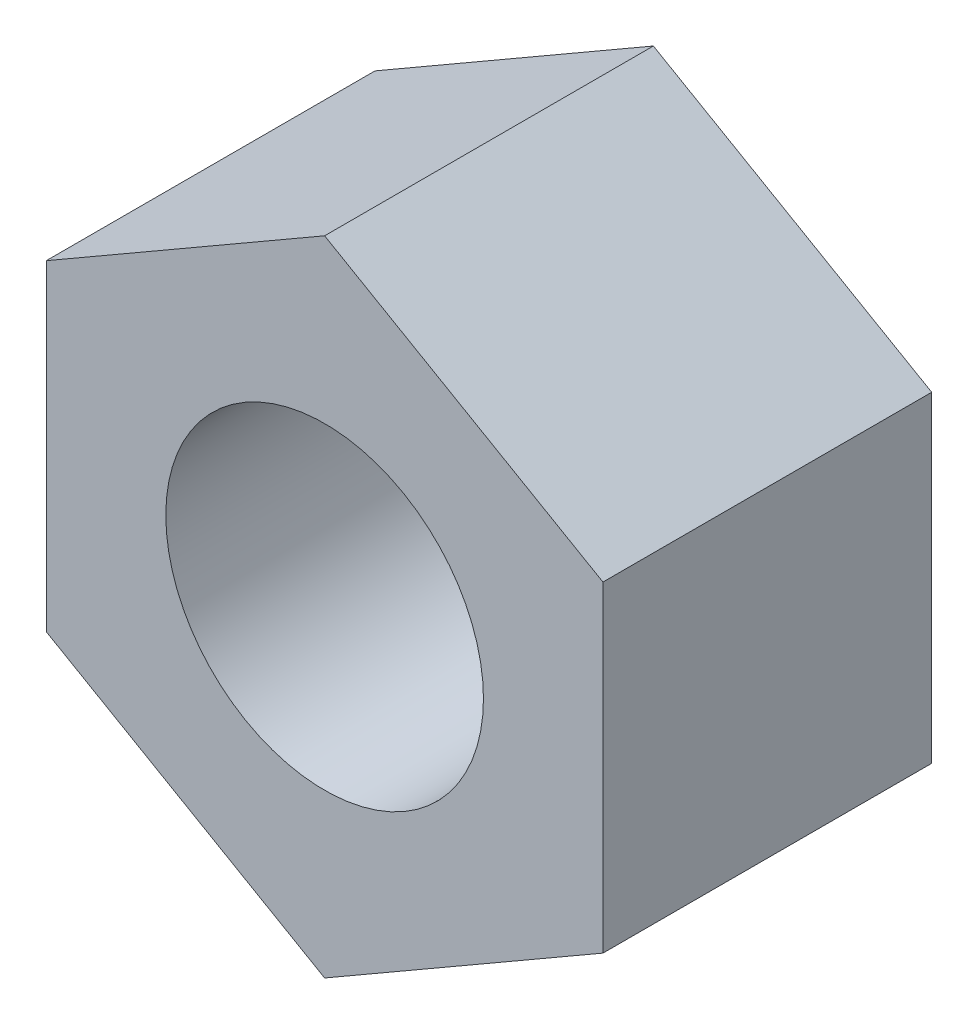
from build123d import *

# Parameters (mm, degrees)
SKETCH1_R          = 4.0005
BASE_EXTRUDE_DEPTH = 8.2804


with BuildPart() as part:
    # Sketch1 → Base-Extrude (new body)
    with BuildSketch(Plane.XY):
        Polygon((0, 8.094912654), (-7.0104, 4.047456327), (-7.0104, -4.047456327), (0, -8.094912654), (7.0104, -4.047456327), (7.0104, 4.047456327), align=None)
        Circle(SKETCH1_R, mode=Mode.SUBTRACT)
    extrude(amount=BASE_EXTRUDE_DEPTH)


solid = part.part
